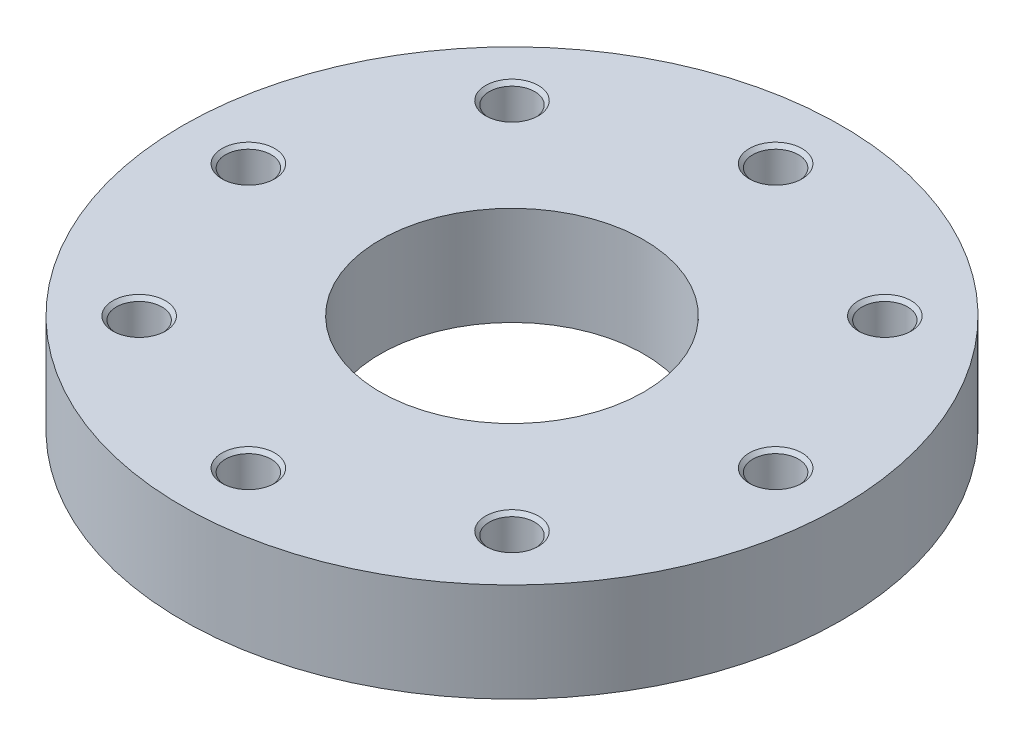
ISO-10303-21;
HEADER;
FILE_DESCRIPTION(('STEP AP214'),'2;1');
FILE_NAME('part.step','',(''),(''),'','','');
FILE_SCHEMA(('AUTOMOTIVE_DESIGN { 1 0 10303 214 1 1 1 1 }'));
ENDSEC;
DATA;
#1=APPLICATION_CONTEXT('core data for automotive mechanical design processes');
#2=APPLICATION_PROTOCOL_DEFINITION('international standard','automotive_design',2000,#1);
#3=PRODUCT_CONTEXT('',#1,'mechanical');
#4=PRODUCT('Part','Part','',(#3));
#5=PRODUCT_RELATED_PRODUCT_CATEGORY('part','',(#4));
#6=PRODUCT_DEFINITION_FORMATION('','',#4);
#7=PRODUCT_DEFINITION_CONTEXT('part definition',#1,'design');
#8=PRODUCT_DEFINITION('design','',#6,#7);
#9=PRODUCT_DEFINITION_SHAPE('','',#8);
#10=(LENGTH_UNIT() NAMED_UNIT(*) SI_UNIT(.MILLI.,.METRE.));
#11=(NAMED_UNIT(*) PLANE_ANGLE_UNIT() SI_UNIT($,.RADIAN.));
#12=(NAMED_UNIT(*) SI_UNIT($,.STERADIAN.) SOLID_ANGLE_UNIT());
#13=UNCERTAINTY_MEASURE_WITH_UNIT(LENGTH_MEASURE(1.E-05),#10,'distance_accuracy_value','');
#14=(GEOMETRIC_REPRESENTATION_CONTEXT(3) GLOBAL_UNCERTAINTY_ASSIGNED_CONTEXT((#13)) GLOBAL_UNIT_ASSIGNED_CONTEXT((#10,
#11,#12)) REPRESENTATION_CONTEXT('',''));
#15=CARTESIAN_POINT('',(0.,0.,0.));
#16=DIRECTION('',(0.,0.,1.));
#17=DIRECTION('',(1.,0.,0.));
#18=AXIS2_PLACEMENT_3D('',#15,#16,#17);
#19=CARTESIAN_POINT('',(0.,15.,0.));
#20=DIRECTION('',(0.,-1.,0.));
#21=DIRECTION('',(1.,0.,0.));
#22=AXIS2_PLACEMENT_3D('',#19,#20,#21);
#23=CYLINDRICAL_SURFACE('',#22,100.);
#24=CARTESIAN_POINT('',(0.,0.,0.));
#25=DIRECTION('',(0.,1.,0.));
#26=DIRECTION('',(1.,0.,0.));
#27=AXIS2_PLACEMENT_3D('',#24,#25,#26);
#28=CIRCLE('',#27,100.);
#29=CARTESIAN_POINT('',(100.,0.,0.));
#30=VERTEX_POINT('',#29);
#31=EDGE_CURVE('E9',#30,#30,#28,.T.);
#32=ORIENTED_EDGE('',*,*,#31,.T.);
#33=EDGE_LOOP('',(#32));
#34=FACE_BOUND('',#33,.T.);
#35=CARTESIAN_POINT('',(0.,30.,0.));
#36=DIRECTION('',(0.,1.,0.));
#37=DIRECTION('',(1.,0.,0.));
#38=AXIS2_PLACEMENT_3D('',#35,#36,#37);
#39=CIRCLE('',#38,100.);
#40=CARTESIAN_POINT('',(100.,30.,0.));
#41=VERTEX_POINT('',#40);
#42=EDGE_CURVE('E257',#41,#41,#39,.T.);
#43=ORIENTED_EDGE('',*,*,#42,.F.);
#44=EDGE_LOOP('',(#43));
#45=FACE_BOUND('',#44,.T.);
#46=ADVANCED_FACE('F15',(#34,#45),#23,.T.);
#47=CARTESIAN_POINT('',(70.,0.,0.));
#48=DIRECTION('',(0.,-1.,0.));
#49=DIRECTION('',(-1.,0.,0.));
#50=AXIS2_PLACEMENT_3D('',#47,#48,#49);
#51=PLANE('',#50);
#52=CARTESIAN_POINT('',(0.,0.,0.));
#53=DIRECTION('',(0.,1.,0.));
#54=DIRECTION('',(1.,0.,0.));
#55=AXIS2_PLACEMENT_3D('',#52,#53,#54);
#56=CIRCLE('',#55,40.);
#57=CARTESIAN_POINT('',(40.,0.,0.));
#58=VERTEX_POINT('',#57);
#59=EDGE_CURVE('E25',#58,#58,#56,.T.);
#60=ORIENTED_EDGE('',*,*,#59,.T.);
#61=EDGE_LOOP('',(#60));
#62=FACE_BOUND('',#61,.T.);
#63=ORIENTED_EDGE('',*,*,#31,.F.);
#64=EDGE_LOOP('',(#63));
#65=FACE_BOUND('',#64,.T.);
#66=ADVANCED_FACE('F322',(#62,#65),#51,.T.);
#67=CARTESIAN_POINT('',(0.,15.,0.));
#68=DIRECTION('',(0.,-1.,0.));
#69=DIRECTION('',(1.,0.,0.));
#70=AXIS2_PLACEMENT_3D('',#67,#68,#69);
#71=CYLINDRICAL_SURFACE('',#70,40.);
#72=CARTESIAN_POINT('',(0.,30.,0.));
#73=DIRECTION('',(0.,1.,0.));
#74=DIRECTION('',(1.,0.,0.));
#75=AXIS2_PLACEMENT_3D('',#72,#73,#74);
#76=CIRCLE('',#75,40.);
#77=CARTESIAN_POINT('',(40.,30.,0.));
#78=VERTEX_POINT('',#77);
#79=EDGE_CURVE('E235',#78,#78,#76,.T.);
#80=ORIENTED_EDGE('',*,*,#79,.T.);
#81=EDGE_LOOP('',(#80));
#82=FACE_BOUND('',#81,.T.);
#83=ORIENTED_EDGE('',*,*,#59,.F.);
#84=EDGE_LOOP('',(#83));
#85=FACE_BOUND('',#84,.T.);
#86=ADVANCED_FACE('F327',(#82,#85),#71,.F.);
#87=CARTESIAN_POINT('',(70.,30.,0.));
#88=DIRECTION('',(0.,1.,0.));
#89=DIRECTION('',(1.,0.,0.));
#90=AXIS2_PLACEMENT_3D('',#87,#88,#89);
#91=PLANE('',#90);
#92=ORIENTED_EDGE('',*,*,#42,.T.);
#93=EDGE_LOOP('',(#92));
#94=FACE_BOUND('',#93,.T.);
#95=ORIENTED_EDGE('',*,*,#79,.F.);
#96=EDGE_LOOP('',(#95));
#97=FACE_BOUND('',#96,.T.);
#98=CARTESIAN_POINT('',(80.,30.,0.));
#99=DIRECTION('',(0.,-1.,0.));
#100=DIRECTION('',(1.,0.,0.));
#101=AXIS2_PLACEMENT_3D('',#98,#99,#100);
#102=CIRCLE('',#101,8.);
#103=CARTESIAN_POINT('',(88.,30.,0.));
#104=VERTEX_POINT('',#103);
#105=EDGE_CURVE('E200',#104,#104,#102,.T.);
#106=ORIENTED_EDGE('',*,*,#105,.T.);
#107=EDGE_LOOP('',(#106));
#108=FACE_BOUND('',#107,.T.);
#109=CARTESIAN_POINT('',(56.5685424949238,30.,-56.5685424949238));
#110=DIRECTION('',(0.,-1.,0.));
#111=DIRECTION('',(0.707106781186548,0.,-0.707106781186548));
#112=AXIS2_PLACEMENT_3D('',#109,#110,#111);
#113=CIRCLE('',#112,8.);
#114=CARTESIAN_POINT('',(62.2253967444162,30.,-62.2253967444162));
#115=VERTEX_POINT('',#114);
#116=EDGE_CURVE('E272',#115,#115,#113,.T.);
#117=ORIENTED_EDGE('',*,*,#116,.T.);
#118=EDGE_LOOP('',(#117));
#119=FACE_BOUND('',#118,.T.);
#120=CARTESIAN_POINT('',(0.,30.,-80.));
#121=DIRECTION('',(0.,-1.,0.));
#122=DIRECTION('',(0.,0.,-1.));
#123=AXIS2_PLACEMENT_3D('',#120,#121,#122);
#124=CIRCLE('',#123,8.);
#125=CARTESIAN_POINT('',(0.,30.,-88.));
#126=VERTEX_POINT('',#125);
#127=EDGE_CURVE('E221',#126,#126,#124,.T.);
#128=ORIENTED_EDGE('',*,*,#127,.T.);
#129=EDGE_LOOP('',(#128));
#130=FACE_BOUND('',#129,.T.);
#131=CARTESIAN_POINT('',(-56.5685424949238,30.,-56.5685424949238));
#132=DIRECTION('',(0.,-1.,0.));
#133=DIRECTION('',(-0.707106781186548,0.,-0.707106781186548));
#134=AXIS2_PLACEMENT_3D('',#131,#132,#133);
#135=CIRCLE('',#134,8.);
#136=CARTESIAN_POINT('',(-62.2253967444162,30.,-62.2253967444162));
#137=VERTEX_POINT('',#136);
#138=EDGE_CURVE('E265',#137,#137,#135,.T.);
#139=ORIENTED_EDGE('',*,*,#138,.T.);
#140=EDGE_LOOP('',(#139));
#141=FACE_BOUND('',#140,.T.);
#142=CARTESIAN_POINT('',(-80.,30.,0.));
#143=DIRECTION('',(0.,-1.,0.));
#144=DIRECTION('',(-1.,0.,0.));
#145=AXIS2_PLACEMENT_3D('',#142,#143,#144);
#146=CIRCLE('',#145,8.);
#147=CARTESIAN_POINT('',(-88.,30.,0.));
#148=VERTEX_POINT('',#147);
#149=EDGE_CURVE('E251',#148,#148,#146,.T.);
#150=ORIENTED_EDGE('',*,*,#149,.T.);
#151=EDGE_LOOP('',(#150));
#152=FACE_BOUND('',#151,.T.);
#153=CARTESIAN_POINT('',(-56.5685424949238,30.,56.5685424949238));
#154=DIRECTION('',(0.,-1.,0.));
#155=DIRECTION('',(-0.707106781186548,0.,0.707106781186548));
#156=AXIS2_PLACEMENT_3D('',#153,#154,#155);
#157=CIRCLE('',#156,8.);
#158=CARTESIAN_POINT('',(-62.2253967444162,30.,62.2253967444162));
#159=VERTEX_POINT('',#158);
#160=EDGE_CURVE('E268',#159,#159,#157,.T.);
#161=ORIENTED_EDGE('',*,*,#160,.T.);
#162=EDGE_LOOP('',(#161));
#163=FACE_BOUND('',#162,.T.);
#164=CARTESIAN_POINT('',(0.,30.,80.));
#165=DIRECTION('',(0.,-1.,0.));
#166=DIRECTION('',(0.,0.,1.));
#167=AXIS2_PLACEMENT_3D('',#164,#165,#166);
#168=CIRCLE('',#167,8.);
#169=CARTESIAN_POINT('',(0.,30.,88.));
#170=VERTEX_POINT('',#169);
#171=EDGE_CURVE('E246',#170,#170,#168,.T.);
#172=ORIENTED_EDGE('',*,*,#171,.T.);
#173=EDGE_LOOP('',(#172));
#174=FACE_BOUND('',#173,.T.);
#175=CARTESIAN_POINT('',(56.5685424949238,30.,56.5685424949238));
#176=DIRECTION('',(0.,-1.,0.));
#177=DIRECTION('',(0.707106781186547,0.,0.707106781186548));
#178=AXIS2_PLACEMENT_3D('',#175,#176,#177);
#179=CIRCLE('',#178,8.);
#180=CARTESIAN_POINT('',(62.2253967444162,30.,62.2253967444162));
#181=VERTEX_POINT('',#180);
#182=EDGE_CURVE('E227',#181,#181,#179,.T.);
#183=ORIENTED_EDGE('',*,*,#182,.T.);
#184=EDGE_LOOP('',(#183));
#185=FACE_BOUND('',#184,.T.);
#186=ADVANCED_FACE('F201',(#94,#97,#108,#119,#130,#141,#152,#163,#174,#185),#91,.T.);
#187=CARTESIAN_POINT('',(80.,5.00308975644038,0.));
#188=DIRECTION('',(0.,1.,0.));
#189=DIRECTION('',(1.,0.,0.));
#190=AXIS2_PLACEMENT_3D('',#187,#188,#189);
#191=CONICAL_SURFACE('',#190,3.45875,1.0471975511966);
#192=CARTESIAN_POINT('',(80.,7.,0.));
#193=DIRECTION('',(0.,-1.,0.));
#194=DIRECTION('',(1.,0.,0.));
#195=AXIS2_PLACEMENT_3D('',#192,#193,#194);
#196=CIRCLE('',#195,6.9175);
#197=CARTESIAN_POINT('',(86.9175,7.,0.));
#198=VERTEX_POINT('',#197);
#199=EDGE_CURVE('E233',#198,#198,#196,.T.);
#200=ORIENTED_EDGE('',*,*,#199,.F.);
#201=EDGE_LOOP('',(#200));
#202=FACE_BOUND('',#201,.T.);
#203=CARTESIAN_POINT('',(80.,3.00617951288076,0.));
#204=VERTEX_POINT('',#203);
#205=VERTEX_LOOP('',#204);
#206=FACE_BOUND('',#205,.T.);
#207=ADVANCED_FACE('F341',(#202,#206),#191,.F.);
#208=CARTESIAN_POINT('',(80.,9.95875,0.));
#209=DIRECTION('',(0.,1.,0.));
#210=DIRECTION('',(1.,0.,0.));
#211=AXIS2_PLACEMENT_3D('',#208,#209,#210);
#212=CYLINDRICAL_SURFACE('',#211,6.9175);
#213=CARTESIAN_POINT('',(80.,12.9175,0.));
#214=DIRECTION('',(0.,-1.,0.));
#215=DIRECTION('',(1.,0.,0.));
#216=AXIS2_PLACEMENT_3D('',#213,#214,#215);
#217=CIRCLE('',#216,6.9175);
#218=CARTESIAN_POINT('',(86.9175,12.9175,0.));
#219=VERTEX_POINT('',#218);
#220=EDGE_CURVE('E236',#219,#219,#217,.T.);
#221=ORIENTED_EDGE('',*,*,#220,.F.);
#222=EDGE_LOOP('',(#221));
#223=FACE_BOUND('',#222,.T.);
#224=ORIENTED_EDGE('',*,*,#199,.T.);
#225=EDGE_LOOP('',(#224));
#226=FACE_BOUND('',#225,.T.);
#227=ADVANCED_FACE('F344',(#223,#226),#212,.F.);
#228=CARTESIAN_POINT('',(80.,13.45875,0.));
#229=DIRECTION('',(0.,1.,0.));
#230=DIRECTION('',(1.,0.,0.));
#231=AXIS2_PLACEMENT_3D('',#228,#229,#230);
#232=CONICAL_SURFACE('',#231,7.45875,0.785398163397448);
#233=CARTESIAN_POINT('',(80.,14.,0.));
#234=DIRECTION('',(0.,-1.,0.));
#235=DIRECTION('',(1.,0.,0.));
#236=AXIS2_PLACEMENT_3D('',#233,#234,#235);
#237=CIRCLE('',#236,8.);
#238=CARTESIAN_POINT('',(88.,14.,0.));
#239=VERTEX_POINT('',#238);
#240=EDGE_CURVE('E206',#239,#239,#237,.T.);
#241=ORIENTED_EDGE('',*,*,#240,.F.);
#242=EDGE_LOOP('',(#241));
#243=FACE_BOUND('',#242,.T.);
#244=ORIENTED_EDGE('',*,*,#220,.T.);
#245=EDGE_LOOP('',(#244));
#246=FACE_BOUND('',#245,.T.);
#247=ADVANCED_FACE('F400',(#243,#246),#232,.F.);
#248=CARTESIAN_POINT('',(87.45875,14.,0.));
#249=DIRECTION('',(0.,1.,0.));
#250=DIRECTION('',(-1.,0.,0.));
#251=AXIS2_PLACEMENT_3D('',#248,#249,#250);
#252=PLANE('',#251);
#253=CARTESIAN_POINT('',(80.,14.,0.));
#254=DIRECTION('',(0.,-1.,0.));
#255=DIRECTION('',(1.,0.,0.));
#256=AXIS2_PLACEMENT_3D('',#253,#254,#255);
#257=CIRCLE('',#256,6.9175);
#258=CARTESIAN_POINT('',(86.9175,14.,0.));
#259=VERTEX_POINT('',#258);
#260=EDGE_CURVE('E194',#259,#259,#257,.T.);
#261=ORIENTED_EDGE('',*,*,#260,.F.);
#262=EDGE_LOOP('',(#261));
#263=FACE_BOUND('',#262,.T.);
#264=ORIENTED_EDGE('',*,*,#240,.T.);
#265=EDGE_LOOP('',(#264));
#266=FACE_BOUND('',#265,.T.);
#267=ADVANCED_FACE('F361',(#263,#266),#252,.F.);
#268=CARTESIAN_POINT('',(80.,21.45875,0.));
#269=DIRECTION('',(0.,1.,0.));
#270=DIRECTION('',(1.,0.,0.));
#271=AXIS2_PLACEMENT_3D('',#268,#269,#270);
#272=CYLINDRICAL_SURFACE('',#271,6.9175);
#273=CARTESIAN_POINT('',(80.,28.9175,0.));
#274=DIRECTION('',(0.,-1.,0.));
#275=DIRECTION('',(1.,0.,0.));
#276=AXIS2_PLACEMENT_3D('',#273,#274,#275);
#277=CIRCLE('',#276,6.9175);
#278=CARTESIAN_POINT('',(86.9175,28.9175,0.));
#279=VERTEX_POINT('',#278);
#280=EDGE_CURVE('E204',#279,#279,#277,.T.);
#281=ORIENTED_EDGE('',*,*,#280,.F.);
#282=EDGE_LOOP('',(#281));
#283=FACE_BOUND('',#282,.T.);
#284=ORIENTED_EDGE('',*,*,#260,.T.);
#285=EDGE_LOOP('',(#284));
#286=FACE_BOUND('',#285,.T.);
#287=ADVANCED_FACE('F357',(#283,#286),#272,.F.);
#288=CARTESIAN_POINT('',(80.,29.45875,0.));
#289=DIRECTION('',(0.,1.,0.));
#290=DIRECTION('',(1.,0.,0.));
#291=AXIS2_PLACEMENT_3D('',#288,#289,#290);
#292=CONICAL_SURFACE('',#291,7.45875,0.785398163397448);
#293=ORIENTED_EDGE('',*,*,#105,.F.);
#294=EDGE_LOOP('',(#293));
#295=FACE_BOUND('',#294,.T.);
#296=ORIENTED_EDGE('',*,*,#280,.T.);
#297=EDGE_LOOP('',(#296));
#298=FACE_BOUND('',#297,.T.);
#299=ADVANCED_FACE('F360',(#295,#298),#292,.F.);
#300=CARTESIAN_POINT('',(56.5685424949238,5.00308975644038,-56.5685424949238));
#301=DIRECTION('',(0.,1.,0.));
#302=DIRECTION('',(0.707106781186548,0.,-0.707106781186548));
#303=AXIS2_PLACEMENT_3D('',#300,#301,#302);
#304=CONICAL_SURFACE('',#303,3.45875,1.0471975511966);
#305=CARTESIAN_POINT('',(56.5685424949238,7.,-56.5685424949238));
#306=DIRECTION('',(0.,-1.,0.));
#307=DIRECTION('',(0.707106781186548,0.,-0.707106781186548));
#308=AXIS2_PLACEMENT_3D('',#305,#306,#307);
#309=CIRCLE('',#308,6.9175);
#310=CARTESIAN_POINT('',(61.4599536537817,7.,-61.4599536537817));
#311=VERTEX_POINT('',#310);
#312=EDGE_CURVE('E208',#311,#311,#309,.T.);
#313=ORIENTED_EDGE('',*,*,#312,.F.);
#314=EDGE_LOOP('',(#313));
#315=FACE_BOUND('',#314,.T.);
#316=CARTESIAN_POINT('',(56.5685424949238,3.00617951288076,-56.5685424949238));
#317=VERTEX_POINT('',#316);
#318=VERTEX_LOOP('',#317);
#319=FACE_BOUND('',#318,.T.);
#320=ADVANCED_FACE('F349',(#315,#319),#304,.F.);
#321=CARTESIAN_POINT('',(56.5685424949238,9.95875,-56.5685424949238));
#322=DIRECTION('',(0.,1.,0.));
#323=DIRECTION('',(0.707106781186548,0.,-0.707106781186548));
#324=AXIS2_PLACEMENT_3D('',#321,#322,#323);
#325=CYLINDRICAL_SURFACE('',#324,6.9175);
#326=CARTESIAN_POINT('',(56.5685424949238,12.9175,-56.5685424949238));
#327=DIRECTION('',(0.,-1.,0.));
#328=DIRECTION('',(0.707106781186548,0.,-0.707106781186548));
#329=AXIS2_PLACEMENT_3D('',#326,#327,#328);
#330=CIRCLE('',#329,6.9175);
#331=CARTESIAN_POINT('',(61.4599536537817,12.9175,-61.4599536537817));
#332=VERTEX_POINT('',#331);
#333=EDGE_CURVE('E231',#332,#332,#330,.T.);
#334=ORIENTED_EDGE('',*,*,#333,.F.);
#335=EDGE_LOOP('',(#334));
#336=FACE_BOUND('',#335,.T.);
#337=ORIENTED_EDGE('',*,*,#312,.T.);
#338=EDGE_LOOP('',(#337));
#339=FACE_BOUND('',#338,.T.);
#340=ADVANCED_FACE('F346',(#336,#339),#325,.F.);
#341=CARTESIAN_POINT('',(56.5685424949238,13.45875,-56.5685424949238));
#342=DIRECTION('',(0.,1.,0.));
#343=DIRECTION('',(0.707106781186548,0.,-0.707106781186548));
#344=AXIS2_PLACEMENT_3D('',#341,#342,#343);
#345=CONICAL_SURFACE('',#344,7.45875,0.785398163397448);
#346=CARTESIAN_POINT('',(56.5685424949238,14.,-56.5685424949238));
#347=DIRECTION('',(0.,-1.,0.));
#348=DIRECTION('',(0.707106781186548,0.,-0.707106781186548));
#349=AXIS2_PLACEMENT_3D('',#346,#347,#348);
#350=CIRCLE('',#349,8.);
#351=CARTESIAN_POINT('',(62.2253967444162,14.,-62.2253967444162));
#352=VERTEX_POINT('',#351);
#353=EDGE_CURVE('E229',#352,#352,#350,.T.);
#354=ORIENTED_EDGE('',*,*,#353,.F.);
#355=EDGE_LOOP('',(#354));
#356=FACE_BOUND('',#355,.T.);
#357=ORIENTED_EDGE('',*,*,#333,.T.);
#358=EDGE_LOOP('',(#357));
#359=FACE_BOUND('',#358,.T.);
#360=ADVANCED_FACE('F333',(#356,#359),#345,.F.);
#361=CARTESIAN_POINT('',(61.842675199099,14.,-61.842675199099));
#362=DIRECTION('',(0.,1.,0.));
#363=DIRECTION('',(-0.707106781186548,0.,0.707106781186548));
#364=AXIS2_PLACEMENT_3D('',#361,#362,#363);
#365=PLANE('',#364);
#366=CARTESIAN_POINT('',(56.5685424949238,14.,-56.5685424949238));
#367=DIRECTION('',(0.,-1.,0.));
#368=DIRECTION('',(0.707106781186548,0.,-0.707106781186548));
#369=AXIS2_PLACEMENT_3D('',#366,#367,#368);
#370=CIRCLE('',#369,6.9175);
#371=CARTESIAN_POINT('',(61.4599536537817,14.,-61.4599536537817));
#372=VERTEX_POINT('',#371);
#373=EDGE_CURVE('E232',#372,#372,#370,.T.);
#374=ORIENTED_EDGE('',*,*,#373,.F.);
#375=EDGE_LOOP('',(#374));
#376=FACE_BOUND('',#375,.T.);
#377=ORIENTED_EDGE('',*,*,#353,.T.);
#378=EDGE_LOOP('',(#377));
#379=FACE_BOUND('',#378,.T.);
#380=ADVANCED_FACE('F551',(#376,#379),#365,.F.);
#381=CARTESIAN_POINT('',(56.5685424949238,21.45875,-56.5685424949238));
#382=DIRECTION('',(0.,1.,0.));
#383=DIRECTION('',(0.707106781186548,0.,-0.707106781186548));
#384=AXIS2_PLACEMENT_3D('',#381,#382,#383);
#385=CYLINDRICAL_SURFACE('',#384,6.9175);
#386=CARTESIAN_POINT('',(56.5685424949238,28.9175,-56.5685424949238));
#387=DIRECTION('',(0.,-1.,0.));
#388=DIRECTION('',(0.707106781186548,0.,-0.707106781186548));
#389=AXIS2_PLACEMENT_3D('',#386,#387,#388);
#390=CIRCLE('',#389,6.9175);
#391=CARTESIAN_POINT('',(61.4599536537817,28.9175,-61.4599536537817));
#392=VERTEX_POINT('',#391);
#393=EDGE_CURVE('E239',#392,#392,#390,.T.);
#394=ORIENTED_EDGE('',*,*,#393,.F.);
#395=EDGE_LOOP('',(#394));
#396=FACE_BOUND('',#395,.T.);
#397=ORIENTED_EDGE('',*,*,#373,.T.);
#398=EDGE_LOOP('',(#397));
#399=FACE_BOUND('',#398,.T.);
#400=ADVANCED_FACE('F17',(#396,#399),#385,.F.);
#401=CARTESIAN_POINT('',(56.5685424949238,29.45875,-56.5685424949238));
#402=DIRECTION('',(0.,1.,0.));
#403=DIRECTION('',(0.707106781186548,0.,-0.707106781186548));
#404=AXIS2_PLACEMENT_3D('',#401,#402,#403);
#405=CONICAL_SURFACE('',#404,7.45875,0.785398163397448);
#406=ORIENTED_EDGE('',*,*,#116,.F.);
#407=EDGE_LOOP('',(#406));
#408=FACE_BOUND('',#407,.T.);
#409=ORIENTED_EDGE('',*,*,#393,.T.);
#410=EDGE_LOOP('',(#409));
#411=FACE_BOUND('',#410,.T.);
#412=ADVANCED_FACE('F382',(#408,#411),#405,.F.);
#413=CARTESIAN_POINT('',(0.,5.00308975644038,-80.));
#414=DIRECTION('',(0.,1.,0.));
#415=DIRECTION('',(0.,0.,-1.));
#416=AXIS2_PLACEMENT_3D('',#413,#414,#415);
#417=CONICAL_SURFACE('',#416,3.45875,1.0471975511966);
#418=CARTESIAN_POINT('',(0.,7.,-80.));
#419=DIRECTION('',(0.,-1.,0.));
#420=DIRECTION('',(0.,0.,-1.));
#421=AXIS2_PLACEMENT_3D('',#418,#419,#420);
#422=CIRCLE('',#421,6.9175);
#423=CARTESIAN_POINT('',(0.,7.,-86.9175));
#424=VERTEX_POINT('',#423);
#425=EDGE_CURVE('E237',#424,#424,#422,.T.);
#426=ORIENTED_EDGE('',*,*,#425,.F.);
#427=EDGE_LOOP('',(#426));
#428=FACE_BOUND('',#427,.T.);
#429=CARTESIAN_POINT('',(0.,3.00617951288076,-80.));
#430=VERTEX_POINT('',#429);
#431=VERTEX_LOOP('',#430);
#432=FACE_BOUND('',#431,.T.);
#433=ADVANCED_FACE('F378',(#428,#432),#417,.F.);
#434=CARTESIAN_POINT('',(0.,9.95875,-80.));
#435=DIRECTION('',(0.,1.,0.));
#436=DIRECTION('',(0.,0.,-1.));
#437=AXIS2_PLACEMENT_3D('',#434,#435,#436);
#438=CYLINDRICAL_SURFACE('',#437,6.9175);
#439=CARTESIAN_POINT('',(0.,12.9175,-80.));
#440=DIRECTION('',(0.,-1.,0.));
#441=DIRECTION('',(0.,0.,-1.));
#442=AXIS2_PLACEMENT_3D('',#439,#440,#441);
#443=CIRCLE('',#442,6.9175);
#444=CARTESIAN_POINT('',(0.,12.9175,-86.9175));
#445=VERTEX_POINT('',#444);
#446=EDGE_CURVE('E240',#445,#445,#443,.T.);
#447=ORIENTED_EDGE('',*,*,#446,.F.);
#448=EDGE_LOOP('',(#447));
#449=FACE_BOUND('',#448,.T.);
#450=ORIENTED_EDGE('',*,*,#425,.T.);
#451=EDGE_LOOP('',(#450));
#452=FACE_BOUND('',#451,.T.);
#453=ADVANCED_FACE('F381',(#449,#452),#438,.F.);
#454=CARTESIAN_POINT('',(0.,13.45875,-80.));
#455=DIRECTION('',(0.,1.,0.));
#456=DIRECTION('',(0.,0.,-1.));
#457=AXIS2_PLACEMENT_3D('',#454,#455,#456);
#458=CONICAL_SURFACE('',#457,7.45875,0.785398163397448);
#459=CARTESIAN_POINT('',(0.,14.,-80.));
#460=DIRECTION('',(0.,-1.,0.));
#461=DIRECTION('',(0.,0.,-1.));
#462=AXIS2_PLACEMENT_3D('',#459,#460,#461);
#463=CIRCLE('',#462,8.);
#464=CARTESIAN_POINT('',(0.,14.,-88.));
#465=VERTEX_POINT('',#464);
#466=EDGE_CURVE('E220',#465,#465,#463,.T.);
#467=ORIENTED_EDGE('',*,*,#466,.F.);
#468=EDGE_LOOP('',(#467));
#469=FACE_BOUND('',#468,.T.);
#470=ORIENTED_EDGE('',*,*,#446,.T.);
#471=EDGE_LOOP('',(#470));
#472=FACE_BOUND('',#471,.T.);
#473=ADVANCED_FACE('F424',(#469,#472),#458,.F.);
#474=CARTESIAN_POINT('',(0.,14.,-87.45875));
#475=DIRECTION('',(0.,1.,0.));
#476=DIRECTION('',(0.,0.,1.));
#477=AXIS2_PLACEMENT_3D('',#474,#475,#476);
#478=PLANE('',#477);
#479=CARTESIAN_POINT('',(0.,14.,-80.));
#480=DIRECTION('',(0.,-1.,0.));
#481=DIRECTION('',(0.,0.,-1.));
#482=AXIS2_PLACEMENT_3D('',#479,#480,#481);
#483=CIRCLE('',#482,6.9175);
#484=CARTESIAN_POINT('',(0.,14.,-86.9175));
#485=VERTEX_POINT('',#484);
#486=EDGE_CURVE('E218',#485,#485,#483,.T.);
#487=ORIENTED_EDGE('',*,*,#486,.F.);
#488=EDGE_LOOP('',(#487));
#489=FACE_BOUND('',#488,.T.);
#490=ORIENTED_EDGE('',*,*,#466,.T.);
#491=EDGE_LOOP('',(#490));
#492=FACE_BOUND('',#491,.T.);
#493=ADVANCED_FACE('F434',(#489,#492),#478,.F.);
#494=CARTESIAN_POINT('',(0.,21.45875,-80.));
#495=DIRECTION('',(0.,1.,0.));
#496=DIRECTION('',(0.,0.,-1.));
#497=AXIS2_PLACEMENT_3D('',#494,#495,#496);
#498=CYLINDRICAL_SURFACE('',#497,6.9175);
#499=CARTESIAN_POINT('',(0.,28.9175,-80.));
#500=DIRECTION('',(0.,-1.,0.));
#501=DIRECTION('',(0.,0.,-1.));
#502=AXIS2_PLACEMENT_3D('',#499,#500,#501);
#503=CIRCLE('',#502,6.9175);
#504=CARTESIAN_POINT('',(0.,28.9175,-86.9175));
#505=VERTEX_POINT('',#504);
#506=EDGE_CURVE('E222',#505,#505,#503,.T.);
#507=ORIENTED_EDGE('',*,*,#506,.F.);
#508=EDGE_LOOP('',(#507));
#509=FACE_BOUND('',#508,.T.);
#510=ORIENTED_EDGE('',*,*,#486,.T.);
#511=EDGE_LOOP('',(#510));
#512=FACE_BOUND('',#511,.T.);
#513=ADVANCED_FACE('F497',(#509,#512),#498,.F.);
#514=CARTESIAN_POINT('',(0.,29.45875,-80.));
#515=DIRECTION('',(0.,1.,0.));
#516=DIRECTION('',(0.,0.,-1.));
#517=AXIS2_PLACEMENT_3D('',#514,#515,#516);
#518=CONICAL_SURFACE('',#517,7.45875,0.785398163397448);
#519=ORIENTED_EDGE('',*,*,#127,.F.);
#520=EDGE_LOOP('',(#519));
#521=FACE_BOUND('',#520,.T.);
#522=ORIENTED_EDGE('',*,*,#506,.T.);
#523=EDGE_LOOP('',(#522));
#524=FACE_BOUND('',#523,.T.);
#525=ADVANCED_FACE('F439',(#521,#524),#518,.F.);
#526=CARTESIAN_POINT('',(-56.5685424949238,5.00308975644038,-56.5685424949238));
#527=DIRECTION('',(0.,1.,0.));
#528=DIRECTION('',(-0.707106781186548,0.,-0.707106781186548));
#529=AXIS2_PLACEMENT_3D('',#526,#527,#528);
#530=CONICAL_SURFACE('',#529,3.45875,1.0471975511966);
#531=CARTESIAN_POINT('',(-56.5685424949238,7.,-56.5685424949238));
#532=DIRECTION('',(0.,-1.,0.));
#533=DIRECTION('',(-0.707106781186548,0.,-0.707106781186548));
#534=AXIS2_PLACEMENT_3D('',#531,#532,#533);
#535=CIRCLE('',#534,6.9175);
#536=CARTESIAN_POINT('',(-61.4599536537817,7.,-61.4599536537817));
#537=VERTEX_POINT('',#536);
#538=EDGE_CURVE('E224',#537,#537,#535,.T.);
#539=ORIENTED_EDGE('',*,*,#538,.F.);
#540=EDGE_LOOP('',(#539));
#541=FACE_BOUND('',#540,.T.);
#542=CARTESIAN_POINT('',(-56.5685424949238,3.00617951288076,-56.5685424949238));
#543=VERTEX_POINT('',#542);
#544=VERTEX_LOOP('',#543);
#545=FACE_BOUND('',#544,.T.);
#546=ADVANCED_FACE('F391',(#541,#545),#530,.F.);
#547=CARTESIAN_POINT('',(-56.5685424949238,9.95875,-56.5685424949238));
#548=DIRECTION('',(0.,1.,0.));
#549=DIRECTION('',(-0.707106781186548,0.,-0.707106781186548));
#550=AXIS2_PLACEMENT_3D('',#547,#548,#549);
#551=CYLINDRICAL_SURFACE('',#550,6.9175);
#552=CARTESIAN_POINT('',(-56.5685424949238,12.9175,-56.5685424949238));
#553=DIRECTION('',(0.,-1.,0.));
#554=DIRECTION('',(-0.707106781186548,0.,-0.707106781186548));
#555=AXIS2_PLACEMENT_3D('',#552,#553,#554);
#556=CIRCLE('',#555,6.9175);
#557=CARTESIAN_POINT('',(-61.4599536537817,12.9175,-61.4599536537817));
#558=VERTEX_POINT('',#557);
#559=EDGE_CURVE('E241',#558,#558,#556,.T.);
#560=ORIENTED_EDGE('',*,*,#559,.F.);
#561=EDGE_LOOP('',(#560));
#562=FACE_BOUND('',#561,.T.);
#563=ORIENTED_EDGE('',*,*,#538,.T.);
#564=EDGE_LOOP('',(#563));
#565=FACE_BOUND('',#564,.T.);
#566=ADVANCED_FACE('F387',(#562,#565),#551,.F.);
#567=CARTESIAN_POINT('',(-56.5685424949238,13.45875,-56.5685424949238));
#568=DIRECTION('',(0.,1.,0.));
#569=DIRECTION('',(-0.707106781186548,0.,-0.707106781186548));
#570=AXIS2_PLACEMENT_3D('',#567,#568,#569);
#571=CONICAL_SURFACE('',#570,7.45875,0.785398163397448);
#572=CARTESIAN_POINT('',(-56.5685424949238,14.,-56.5685424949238));
#573=DIRECTION('',(0.,-1.,0.));
#574=DIRECTION('',(-0.707106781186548,0.,-0.707106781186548));
#575=AXIS2_PLACEMENT_3D('',#572,#573,#574);
#576=CIRCLE('',#575,8.);
#577=CARTESIAN_POINT('',(-62.2253967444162,14.,-62.2253967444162));
#578=VERTEX_POINT('',#577);
#579=EDGE_CURVE('E243',#578,#578,#576,.T.);
#580=ORIENTED_EDGE('',*,*,#579,.F.);
#581=EDGE_LOOP('',(#580));
#582=FACE_BOUND('',#581,.T.);
#583=ORIENTED_EDGE('',*,*,#559,.T.);
#584=EDGE_LOOP('',(#583));
#585=FACE_BOUND('',#584,.T.);
#586=ADVANCED_FACE('F390',(#582,#585),#571,.F.);
#587=CARTESIAN_POINT('',(-61.842675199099,14.,-61.842675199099));
#588=DIRECTION('',(0.,1.,0.));
#589=DIRECTION('',(0.707106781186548,0.,0.707106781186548));
#590=AXIS2_PLACEMENT_3D('',#587,#588,#589);
#591=PLANE('',#590);
#592=CARTESIAN_POINT('',(-56.5685424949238,14.,-56.5685424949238));
#593=DIRECTION('',(0.,-1.,0.));
#594=DIRECTION('',(-0.707106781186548,0.,-0.707106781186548));
#595=AXIS2_PLACEMENT_3D('',#592,#593,#594);
#596=CIRCLE('',#595,6.9175);
#597=CARTESIAN_POINT('',(-61.4599536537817,14.,-61.4599536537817));
#598=VERTEX_POINT('',#597);
#599=EDGE_CURVE('E255',#598,#598,#596,.T.);
#600=ORIENTED_EDGE('',*,*,#599,.F.);
#601=EDGE_LOOP('',(#600));
#602=FACE_BOUND('',#601,.T.);
#603=ORIENTED_EDGE('',*,*,#579,.T.);
#604=EDGE_LOOP('',(#603));
#605=FACE_BOUND('',#604,.T.);
#606=ADVANCED_FACE('F364',(#602,#605),#591,.F.);
#607=CARTESIAN_POINT('',(-56.5685424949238,21.45875,-56.5685424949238));
#608=DIRECTION('',(0.,1.,0.));
#609=DIRECTION('',(-0.707106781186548,0.,-0.707106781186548));
#610=AXIS2_PLACEMENT_3D('',#607,#608,#609);
#611=CYLINDRICAL_SURFACE('',#610,6.9175);
#612=CARTESIAN_POINT('',(-56.5685424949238,28.9175,-56.5685424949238));
#613=DIRECTION('',(0.,-1.,0.));
#614=DIRECTION('',(-0.707106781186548,0.,-0.707106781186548));
#615=AXIS2_PLACEMENT_3D('',#612,#613,#614);
#616=CIRCLE('',#615,6.9175);
#617=CARTESIAN_POINT('',(-61.4599536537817,28.9175,-61.4599536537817));
#618=VERTEX_POINT('',#617);
#619=EDGE_CURVE('E267',#618,#618,#616,.T.);
#620=ORIENTED_EDGE('',*,*,#619,.F.);
#621=EDGE_LOOP('',(#620));
#622=FACE_BOUND('',#621,.T.);
#623=ORIENTED_EDGE('',*,*,#599,.T.);
#624=EDGE_LOOP('',(#623));
#625=FACE_BOUND('',#624,.T.);
#626=ADVANCED_FACE('F339',(#622,#625),#611,.F.);
#627=CARTESIAN_POINT('',(-56.5685424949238,29.45875,-56.5685424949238));
#628=DIRECTION('',(0.,1.,0.));
#629=DIRECTION('',(-0.707106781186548,0.,-0.707106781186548));
#630=AXIS2_PLACEMENT_3D('',#627,#628,#629);
#631=CONICAL_SURFACE('',#630,7.45875,0.785398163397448);
#632=ORIENTED_EDGE('',*,*,#138,.F.);
#633=EDGE_LOOP('',(#632));
#634=FACE_BOUND('',#633,.T.);
#635=ORIENTED_EDGE('',*,*,#619,.T.);
#636=EDGE_LOOP('',(#635));
#637=FACE_BOUND('',#636,.T.);
#638=ADVANCED_FACE('F335',(#634,#637),#631,.F.);
#639=CARTESIAN_POINT('',(-80.,5.00308975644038,0.));
#640=DIRECTION('',(0.,1.,0.));
#641=DIRECTION('',(-1.,0.,0.));
#642=AXIS2_PLACEMENT_3D('',#639,#640,#641);
#643=CONICAL_SURFACE('',#642,3.45875,1.0471975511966);
#644=CARTESIAN_POINT('',(-80.,7.,0.));
#645=DIRECTION('',(0.,-1.,0.));
#646=DIRECTION('',(-1.,0.,0.));
#647=AXIS2_PLACEMENT_3D('',#644,#645,#646);
#648=CIRCLE('',#647,6.9175);
#649=CARTESIAN_POINT('',(-86.9175,7.,0.));
#650=VERTEX_POINT('',#649);
#651=EDGE_CURVE('E212',#650,#650,#648,.T.);
#652=ORIENTED_EDGE('',*,*,#651,.F.);
#653=EDGE_LOOP('',(#652));
#654=FACE_BOUND('',#653,.T.);
#655=CARTESIAN_POINT('',(-80.,3.00617951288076,0.));
#656=VERTEX_POINT('',#655);
#657=VERTEX_LOOP('',#656);
#658=FACE_BOUND('',#657,.T.);
#659=ADVANCED_FACE('F338',(#654,#658),#643,.F.);
#660=CARTESIAN_POINT('',(-80.,9.95875,0.));
#661=DIRECTION('',(0.,1.,0.));
#662=DIRECTION('',(-1.,0.,0.));
#663=AXIS2_PLACEMENT_3D('',#660,#661,#662);
#664=CYLINDRICAL_SURFACE('',#663,6.9175);
#665=CARTESIAN_POINT('',(-80.,12.9175,0.));
#666=DIRECTION('',(0.,-1.,0.));
#667=DIRECTION('',(-1.,0.,0.));
#668=AXIS2_PLACEMENT_3D('',#665,#666,#667);
#669=CIRCLE('',#668,6.9175);
#670=CARTESIAN_POINT('',(-86.9175,12.9175,0.));
#671=VERTEX_POINT('',#670);
#672=EDGE_CURVE('E278',#671,#671,#669,.T.);
#673=ORIENTED_EDGE('',*,*,#672,.F.);
#674=EDGE_LOOP('',(#673));
#675=FACE_BOUND('',#674,.T.);
#676=ORIENTED_EDGE('',*,*,#651,.T.);
#677=EDGE_LOOP('',(#676));
#678=FACE_BOUND('',#677,.T.);
#679=ADVANCED_FACE('F490',(#675,#678),#664,.F.);
#680=CARTESIAN_POINT('',(-80.,13.45875,0.));
#681=DIRECTION('',(0.,1.,0.));
#682=DIRECTION('',(-1.,0.,0.));
#683=AXIS2_PLACEMENT_3D('',#680,#681,#682);
#684=CONICAL_SURFACE('',#683,7.45875,0.785398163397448);
#685=CARTESIAN_POINT('',(-80.,14.,0.));
#686=DIRECTION('',(0.,-1.,0.));
#687=DIRECTION('',(-1.,0.,0.));
#688=AXIS2_PLACEMENT_3D('',#685,#686,#687);
#689=CIRCLE('',#688,8.);
#690=CARTESIAN_POINT('',(-88.,14.,0.));
#691=VERTEX_POINT('',#690);
#692=EDGE_CURVE('E279',#691,#691,#689,.T.);
#693=ORIENTED_EDGE('',*,*,#692,.F.);
#694=EDGE_LOOP('',(#693));
#695=FACE_BOUND('',#694,.T.);
#696=ORIENTED_EDGE('',*,*,#672,.T.);
#697=EDGE_LOOP('',(#696));
#698=FACE_BOUND('',#697,.T.);
#699=ADVANCED_FACE('F355',(#695,#698),#684,.F.);
#700=CARTESIAN_POINT('',(-87.45875,14.,0.));
#701=DIRECTION('',(0.,1.,0.));
#702=DIRECTION('',(1.,0.,0.));
#703=AXIS2_PLACEMENT_3D('',#700,#701,#702);
#704=PLANE('',#703);
#705=CARTESIAN_POINT('',(-80.,14.,0.));
#706=DIRECTION('',(0.,-1.,0.));
#707=DIRECTION('',(-1.,0.,0.));
#708=AXIS2_PLACEMENT_3D('',#705,#706,#707);
#709=CIRCLE('',#708,6.9175);
#710=CARTESIAN_POINT('',(-86.9175,14.,0.));
#711=VERTEX_POINT('',#710);
#712=EDGE_CURVE('E295',#711,#711,#709,.T.);
#713=ORIENTED_EDGE('',*,*,#712,.F.);
#714=EDGE_LOOP('',(#713));
#715=FACE_BOUND('',#714,.T.);
#716=ORIENTED_EDGE('',*,*,#692,.T.);
#717=EDGE_LOOP('',(#716));
#718=FACE_BOUND('',#717,.T.);
#719=ADVANCED_FACE('F351',(#715,#718),#704,.F.);
#720=CARTESIAN_POINT('',(-80.,21.45875,0.));
#721=DIRECTION('',(0.,1.,0.));
#722=DIRECTION('',(-1.,0.,0.));
#723=AXIS2_PLACEMENT_3D('',#720,#721,#722);
#724=CYLINDRICAL_SURFACE('',#723,6.9175);
#725=CARTESIAN_POINT('',(-80.,28.9175,0.));
#726=DIRECTION('',(0.,-1.,0.));
#727=DIRECTION('',(-1.,0.,0.));
#728=AXIS2_PLACEMENT_3D('',#725,#726,#727);
#729=CIRCLE('',#728,6.9175);
#730=CARTESIAN_POINT('',(-86.9175,28.9175,0.));
#731=VERTEX_POINT('',#730);
#732=EDGE_CURVE('E248',#731,#731,#729,.T.);
#733=ORIENTED_EDGE('',*,*,#732,.F.);
#734=EDGE_LOOP('',(#733));
#735=FACE_BOUND('',#734,.T.);
#736=ORIENTED_EDGE('',*,*,#712,.T.);
#737=EDGE_LOOP('',(#736));
#738=FACE_BOUND('',#737,.T.);
#739=ADVANCED_FACE('F354',(#735,#738),#724,.F.);
#740=CARTESIAN_POINT('',(-80.,29.45875,0.));
#741=DIRECTION('',(0.,1.,0.));
#742=DIRECTION('',(-1.,0.,0.));
#743=AXIS2_PLACEMENT_3D('',#740,#741,#742);
#744=CONICAL_SURFACE('',#743,7.45875,0.785398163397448);
#745=ORIENTED_EDGE('',*,*,#149,.F.);
#746=EDGE_LOOP('',(#745));
#747=FACE_BOUND('',#746,.T.);
#748=ORIENTED_EDGE('',*,*,#732,.T.);
#749=EDGE_LOOP('',(#748));
#750=FACE_BOUND('',#749,.T.);
#751=ADVANCED_FACE('F371',(#747,#750),#744,.F.);
#752=CARTESIAN_POINT('',(-56.5685424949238,5.00308975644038,56.5685424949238));
#753=DIRECTION('',(0.,1.,0.));
#754=DIRECTION('',(-0.707106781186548,0.,0.707106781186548));
#755=AXIS2_PLACEMENT_3D('',#752,#753,#754);
#756=CONICAL_SURFACE('',#755,3.45875,1.0471975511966);
#757=CARTESIAN_POINT('',(-56.5685424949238,7.,56.5685424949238));
#758=DIRECTION('',(0.,-1.,0.));
#759=DIRECTION('',(-0.707106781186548,0.,0.707106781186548));
#760=AXIS2_PLACEMENT_3D('',#757,#758,#759);
#761=CIRCLE('',#760,6.9175);
#762=CARTESIAN_POINT('',(-61.4599536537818,7.,61.4599536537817));
#763=VERTEX_POINT('',#762);
#764=EDGE_CURVE('E252',#763,#763,#761,.T.);
#765=ORIENTED_EDGE('',*,*,#764,.F.);
#766=EDGE_LOOP('',(#765));
#767=FACE_BOUND('',#766,.T.);
#768=CARTESIAN_POINT('',(-56.5685424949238,3.00617951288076,56.5685424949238));
#769=VERTEX_POINT('',#768);
#770=VERTEX_LOOP('',#769);
#771=FACE_BOUND('',#770,.T.);
#772=ADVANCED_FACE('F367',(#767,#771),#756,.F.);
#773=CARTESIAN_POINT('',(-56.5685424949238,9.95875,56.5685424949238));
#774=DIRECTION('',(0.,1.,0.));
#775=DIRECTION('',(-0.707106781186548,0.,0.707106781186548));
#776=AXIS2_PLACEMENT_3D('',#773,#774,#775);
#777=CYLINDRICAL_SURFACE('',#776,6.9175);
#778=CARTESIAN_POINT('',(-56.5685424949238,12.9175,56.5685424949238));
#779=DIRECTION('',(0.,-1.,0.));
#780=DIRECTION('',(-0.707106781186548,0.,0.707106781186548));
#781=AXIS2_PLACEMENT_3D('',#778,#779,#780);
#782=CIRCLE('',#781,6.9175);
#783=CARTESIAN_POINT('',(-61.4599536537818,12.9175,61.4599536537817));
#784=VERTEX_POINT('',#783);
#785=EDGE_CURVE('E216',#784,#784,#782,.T.);
#786=ORIENTED_EDGE('',*,*,#785,.F.);
#787=EDGE_LOOP('',(#786));
#788=FACE_BOUND('',#787,.T.);
#789=ORIENTED_EDGE('',*,*,#764,.T.);
#790=EDGE_LOOP('',(#789));
#791=FACE_BOUND('',#790,.T.);
#792=ADVANCED_FACE('F370',(#788,#791),#777,.F.);
#793=CARTESIAN_POINT('',(-56.5685424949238,13.45875,56.5685424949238));
#794=DIRECTION('',(0.,1.,0.));
#795=DIRECTION('',(-0.707106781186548,0.,0.707106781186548));
#796=AXIS2_PLACEMENT_3D('',#793,#794,#795);
#797=CONICAL_SURFACE('',#796,7.45875,0.785398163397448);
#798=CARTESIAN_POINT('',(-56.5685424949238,14.,56.5685424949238));
#799=DIRECTION('',(0.,-1.,0.));
#800=DIRECTION('',(-0.707106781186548,0.,0.707106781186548));
#801=AXIS2_PLACEMENT_3D('',#798,#799,#800);
#802=CIRCLE('',#801,8.);
#803=CARTESIAN_POINT('',(-62.2253967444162,14.,62.2253967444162));
#804=VERTEX_POINT('',#803);
#805=EDGE_CURVE('E214',#804,#804,#802,.T.);
#806=ORIENTED_EDGE('',*,*,#805,.F.);
#807=EDGE_LOOP('',(#806));
#808=FACE_BOUND('',#807,.T.);
#809=ORIENTED_EDGE('',*,*,#785,.T.);
#810=EDGE_LOOP('',(#809));
#811=FACE_BOUND('',#810,.T.);
#812=ADVANCED_FACE('F373',(#808,#811),#797,.F.);
#813=CARTESIAN_POINT('',(-61.842675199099,14.,61.842675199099));
#814=DIRECTION('',(0.,1.,0.));
#815=DIRECTION('',(0.707106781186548,0.,-0.707106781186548));
#816=AXIS2_PLACEMENT_3D('',#813,#814,#815);
#817=PLANE('',#816);
#818=CARTESIAN_POINT('',(-56.5685424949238,14.,56.5685424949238));
#819=DIRECTION('',(0.,-1.,0.));
#820=DIRECTION('',(-0.707106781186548,0.,0.707106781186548));
#821=AXIS2_PLACEMENT_3D('',#818,#819,#820);
#822=CIRCLE('',#821,6.9175);
#823=CARTESIAN_POINT('',(-61.4599536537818,14.,61.4599536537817));
#824=VERTEX_POINT('',#823);
#825=EDGE_CURVE('E217',#824,#824,#822,.T.);
#826=ORIENTED_EDGE('',*,*,#825,.F.);
#827=EDGE_LOOP('',(#826));
#828=FACE_BOUND('',#827,.T.);
#829=ORIENTED_EDGE('',*,*,#805,.T.);
#830=EDGE_LOOP('',(#829));
#831=FACE_BOUND('',#830,.T.);
#832=ADVANCED_FACE('F376',(#828,#831),#817,.F.);
#833=CARTESIAN_POINT('',(-56.5685424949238,21.45875,56.5685424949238));
#834=DIRECTION('',(0.,1.,0.));
#835=DIRECTION('',(-0.707106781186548,0.,0.707106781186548));
#836=AXIS2_PLACEMENT_3D('',#833,#834,#835);
#837=CYLINDRICAL_SURFACE('',#836,6.9175);
#838=CARTESIAN_POINT('',(-56.5685424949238,28.9175,56.5685424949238));
#839=DIRECTION('',(0.,-1.,0.));
#840=DIRECTION('',(-0.707106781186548,0.,0.707106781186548));
#841=AXIS2_PLACEMENT_3D('',#838,#839,#840);
#842=CIRCLE('',#841,6.9175);
#843=CARTESIAN_POINT('',(-61.4599536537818,28.9175,61.4599536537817));
#844=VERTEX_POINT('',#843);
#845=EDGE_CURVE('E260',#844,#844,#842,.T.);
#846=ORIENTED_EDGE('',*,*,#845,.F.);
#847=EDGE_LOOP('',(#846));
#848=FACE_BOUND('',#847,.T.);
#849=ORIENTED_EDGE('',*,*,#825,.T.);
#850=EDGE_LOOP('',(#849));
#851=FACE_BOUND('',#850,.T.);
#852=ADVANCED_FACE('F317',(#848,#851),#837,.F.);
#853=CARTESIAN_POINT('',(-56.5685424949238,29.45875,56.5685424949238));
#854=DIRECTION('',(0.,1.,0.));
#855=DIRECTION('',(-0.707106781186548,0.,0.707106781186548));
#856=AXIS2_PLACEMENT_3D('',#853,#854,#855);
#857=CONICAL_SURFACE('',#856,7.45875,0.785398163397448);
#858=ORIENTED_EDGE('',*,*,#160,.F.);
#859=EDGE_LOOP('',(#858));
#860=FACE_BOUND('',#859,.T.);
#861=ORIENTED_EDGE('',*,*,#845,.T.);
#862=EDGE_LOOP('',(#861));
#863=FACE_BOUND('',#862,.T.);
#864=ADVANCED_FACE('F311',(#860,#863),#857,.F.);
#865=CARTESIAN_POINT('',(0.,5.00308975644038,80.));
#866=DIRECTION('',(0.,1.,0.));
#867=DIRECTION('',(0.,0.,1.));
#868=AXIS2_PLACEMENT_3D('',#865,#866,#867);
#869=CONICAL_SURFACE('',#868,3.45875,1.0471975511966);
#870=CARTESIAN_POINT('',(0.,7.,80.));
#871=DIRECTION('',(0.,-1.,0.));
#872=DIRECTION('',(0.,0.,1.));
#873=AXIS2_PLACEMENT_3D('',#870,#871,#872);
#874=CIRCLE('',#873,6.9175);
#875=CARTESIAN_POINT('',(0.,7.,86.9175));
#876=VERTEX_POINT('',#875);
#877=EDGE_CURVE('E258',#876,#876,#874,.T.);
#878=ORIENTED_EDGE('',*,*,#877,.F.);
#879=EDGE_LOOP('',(#878));
#880=FACE_BOUND('',#879,.T.);
#881=CARTESIAN_POINT('',(0.,3.00617951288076,80.));
#882=VERTEX_POINT('',#881);
#883=VERTEX_LOOP('',#882);
#884=FACE_BOUND('',#883,.T.);
#885=ADVANCED_FACE('F306',(#880,#884),#869,.F.);
#886=CARTESIAN_POINT('',(0.,9.95875,80.));
#887=DIRECTION('',(0.,1.,0.));
#888=DIRECTION('',(0.,0.,1.));
#889=AXIS2_PLACEMENT_3D('',#886,#887,#888);
#890=CYLINDRICAL_SURFACE('',#889,6.9175);
#891=CARTESIAN_POINT('',(0.,12.9175,80.));
#892=DIRECTION('',(0.,-1.,0.));
#893=DIRECTION('',(0.,0.,1.));
#894=AXIS2_PLACEMENT_3D('',#891,#892,#893);
#895=CIRCLE('',#894,6.9175);
#896=CARTESIAN_POINT('',(0.,12.9175,86.9175));
#897=VERTEX_POINT('',#896);
#898=EDGE_CURVE('E261',#897,#897,#895,.T.);
#899=ORIENTED_EDGE('',*,*,#898,.F.);
#900=EDGE_LOOP('',(#899));
#901=FACE_BOUND('',#900,.T.);
#902=ORIENTED_EDGE('',*,*,#877,.T.);
#903=EDGE_LOOP('',(#902));
#904=FACE_BOUND('',#903,.T.);
#905=ADVANCED_FACE('F303',(#901,#904),#890,.F.);
#906=CARTESIAN_POINT('',(0.,13.45875,80.));
#907=DIRECTION('',(0.,1.,0.));
#908=DIRECTION('',(0.,0.,1.));
#909=AXIS2_PLACEMENT_3D('',#906,#907,#908);
#910=CONICAL_SURFACE('',#909,7.45875,0.785398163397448);
#911=CARTESIAN_POINT('',(0.,14.,80.));
#912=DIRECTION('',(0.,-1.,0.));
#913=DIRECTION('',(0.,0.,1.));
#914=AXIS2_PLACEMENT_3D('',#911,#912,#913);
#915=CIRCLE('',#914,8.);
#916=CARTESIAN_POINT('',(0.,14.,88.));
#917=VERTEX_POINT('',#916);
#918=EDGE_CURVE('E264',#917,#917,#915,.T.);
#919=ORIENTED_EDGE('',*,*,#918,.F.);
#920=EDGE_LOOP('',(#919));
#921=FACE_BOUND('',#920,.T.);
#922=ORIENTED_EDGE('',*,*,#898,.T.);
#923=EDGE_LOOP('',(#922));
#924=FACE_BOUND('',#923,.T.);
#925=ADVANCED_FACE('F301',(#921,#924),#910,.F.);
#926=CARTESIAN_POINT('',(0.,14.,87.45875));
#927=DIRECTION('',(0.,1.,0.));
#928=DIRECTION('',(0.,0.,-1.));
#929=AXIS2_PLACEMENT_3D('',#926,#927,#928);
#930=PLANE('',#929);
#931=CARTESIAN_POINT('',(0.,14.,80.));
#932=DIRECTION('',(0.,-1.,0.));
#933=DIRECTION('',(0.,0.,1.));
#934=AXIS2_PLACEMENT_3D('',#931,#932,#933);
#935=CIRCLE('',#934,6.9175);
#936=CARTESIAN_POINT('',(0.,14.,86.9175));
#937=VERTEX_POINT('',#936);
#938=EDGE_CURVE('E262',#937,#937,#935,.T.);
#939=ORIENTED_EDGE('',*,*,#938,.F.);
#940=EDGE_LOOP('',(#939));
#941=FACE_BOUND('',#940,.T.);
#942=ORIENTED_EDGE('',*,*,#918,.T.);
#943=EDGE_LOOP('',(#942));
#944=FACE_BOUND('',#943,.T.);
#945=ADVANCED_FACE('F441',(#941,#944),#930,.F.);
#946=CARTESIAN_POINT('',(0.,21.45875,80.));
#947=DIRECTION('',(0.,1.,0.));
#948=DIRECTION('',(0.,0.,1.));
#949=AXIS2_PLACEMENT_3D('',#946,#947,#948);
#950=CYLINDRICAL_SURFACE('',#949,6.9175);
#951=CARTESIAN_POINT('',(0.,28.9175,80.));
#952=DIRECTION('',(0.,-1.,0.));
#953=DIRECTION('',(0.,0.,1.));
#954=AXIS2_PLACEMENT_3D('',#951,#952,#953);
#955=CIRCLE('',#954,6.9175);
#956=CARTESIAN_POINT('',(0.,28.9175,86.9175));
#957=VERTEX_POINT('',#956);
#958=EDGE_CURVE('E244',#957,#957,#955,.T.);
#959=ORIENTED_EDGE('',*,*,#958,.F.);
#960=EDGE_LOOP('',(#959));
#961=FACE_BOUND('',#960,.T.);
#962=ORIENTED_EDGE('',*,*,#938,.T.);
#963=EDGE_LOOP('',(#962));
#964=FACE_BOUND('',#963,.T.);
#965=ADVANCED_FACE('F444',(#961,#964),#950,.F.);
#966=CARTESIAN_POINT('',(0.,29.45875,80.));
#967=DIRECTION('',(0.,1.,0.));
#968=DIRECTION('',(0.,0.,1.));
#969=AXIS2_PLACEMENT_3D('',#966,#967,#968);
#970=CONICAL_SURFACE('',#969,7.45875,0.785398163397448);
#971=ORIENTED_EDGE('',*,*,#171,.F.);
#972=EDGE_LOOP('',(#971));
#973=FACE_BOUND('',#972,.T.);
#974=ORIENTED_EDGE('',*,*,#958,.T.);
#975=EDGE_LOOP('',(#974));
#976=FACE_BOUND('',#975,.T.);
#977=ADVANCED_FACE('F483',(#973,#976),#970,.F.);
#978=CARTESIAN_POINT('',(56.5685424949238,5.00308975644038,56.5685424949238));
#979=DIRECTION('',(0.,1.,0.));
#980=DIRECTION('',(0.707106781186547,0.,0.707106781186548));
#981=AXIS2_PLACEMENT_3D('',#978,#979,#980);
#982=CONICAL_SURFACE('',#981,3.45875,1.0471975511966);
#983=CARTESIAN_POINT('',(56.5685424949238,7.,56.5685424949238));
#984=DIRECTION('',(0.,-1.,0.));
#985=DIRECTION('',(0.707106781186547,0.,0.707106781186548));
#986=AXIS2_PLACEMENT_3D('',#983,#984,#985);
#987=CIRCLE('',#986,6.9175);
#988=CARTESIAN_POINT('',(61.4599536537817,7.,61.4599536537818));
#989=VERTEX_POINT('',#988);
#990=EDGE_CURVE('E247',#989,#989,#987,.T.);
#991=ORIENTED_EDGE('',*,*,#990,.F.);
#992=EDGE_LOOP('',(#991));
#993=FACE_BOUND('',#992,.T.);
#994=CARTESIAN_POINT('',(56.5685424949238,3.00617951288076,56.5685424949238));
#995=VERTEX_POINT('',#994);
#996=VERTEX_LOOP('',#995);
#997=FACE_BOUND('',#996,.T.);
#998=ADVANCED_FACE('F470',(#993,#997),#982,.F.);
#999=CARTESIAN_POINT('',(56.5685424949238,9.95875,56.5685424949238));
#1000=DIRECTION('',(0.,1.,0.));
#1001=DIRECTION('',(0.707106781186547,0.,0.707106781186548));
#1002=AXIS2_PLACEMENT_3D('',#999,#1000,#1001);
#1003=CYLINDRICAL_SURFACE('',#1002,6.9175);
#1004=CARTESIAN_POINT('',(56.5685424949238,12.9175,56.5685424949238));
#1005=DIRECTION('',(0.,-1.,0.));
#1006=DIRECTION('',(0.707106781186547,0.,0.707106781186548));
#1007=AXIS2_PLACEMENT_3D('',#1004,#1005,#1006);
#1008=CIRCLE('',#1007,6.9175);
#1009=CARTESIAN_POINT('',(61.4599536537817,12.9175,61.4599536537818));
#1010=VERTEX_POINT('',#1009);
#1011=EDGE_CURVE('E280',#1010,#1010,#1008,.T.);
#1012=ORIENTED_EDGE('',*,*,#1011,.F.);
#1013=EDGE_LOOP('',(#1012));
#1014=FACE_BOUND('',#1013,.T.);
#1015=ORIENTED_EDGE('',*,*,#990,.T.);
#1016=EDGE_LOOP('',(#1015));
#1017=FACE_BOUND('',#1016,.T.);
#1018=ADVANCED_FACE('F462',(#1014,#1017),#1003,.F.);
#1019=CARTESIAN_POINT('',(56.5685424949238,13.45875,56.5685424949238));
#1020=DIRECTION('',(0.,1.,0.));
#1021=DIRECTION('',(0.707106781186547,0.,0.707106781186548));
#1022=AXIS2_PLACEMENT_3D('',#1019,#1020,#1021);
#1023=CONICAL_SURFACE('',#1022,7.45875,0.785398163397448);
#1024=CARTESIAN_POINT('',(56.5685424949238,14.,56.5685424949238));
#1025=DIRECTION('',(0.,-1.,0.));
#1026=DIRECTION('',(0.707106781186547,0.,0.707106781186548));
#1027=AXIS2_PLACEMENT_3D('',#1024,#1025,#1026);
#1028=CIRCLE('',#1027,8.);
#1029=CARTESIAN_POINT('',(62.2253967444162,14.,62.2253967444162));
#1030=VERTEX_POINT('',#1029);
#1031=EDGE_CURVE('E281',#1030,#1030,#1028,.T.);
#1032=ORIENTED_EDGE('',*,*,#1031,.F.);
#1033=EDGE_LOOP('',(#1032));
#1034=FACE_BOUND('',#1033,.T.);
#1035=ORIENTED_EDGE('',*,*,#1011,.T.);
#1036=EDGE_LOOP('',(#1035));
#1037=FACE_BOUND('',#1036,.T.);
#1038=ADVANCED_FACE('F457',(#1034,#1037),#1023,.F.);
#1039=CARTESIAN_POINT('',(61.8426751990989,14.,61.842675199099));
#1040=DIRECTION('',(0.,1.,0.));
#1041=DIRECTION('',(-0.707106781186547,0.,-0.707106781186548));
#1042=AXIS2_PLACEMENT_3D('',#1039,#1040,#1041);
#1043=PLANE('',#1042);
#1044=CARTESIAN_POINT('',(56.5685424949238,14.,56.5685424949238));
#1045=DIRECTION('',(0.,-1.,0.));
#1046=DIRECTION('',(0.707106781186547,0.,0.707106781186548));
#1047=AXIS2_PLACEMENT_3D('',#1044,#1045,#1046);
#1048=CIRCLE('',#1047,6.9175);
#1049=CARTESIAN_POINT('',(61.4599536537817,14.,61.4599536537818));
#1050=VERTEX_POINT('',#1049);
#1051=EDGE_CURVE('E19',#1050,#1050,#1048,.T.);
#1052=ORIENTED_EDGE('',*,*,#1051,.F.);
#1053=EDGE_LOOP('',(#1052));
#1054=FACE_BOUND('',#1053,.T.);
#1055=ORIENTED_EDGE('',*,*,#1031,.T.);
#1056=EDGE_LOOP('',(#1055));
#1057=FACE_BOUND('',#1056,.T.);
#1058=ADVANCED_FACE('F451',(#1054,#1057),#1043,.F.);
#1059=CARTESIAN_POINT('',(56.5685424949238,21.45875,56.5685424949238));
#1060=DIRECTION('',(0.,1.,0.));
#1061=DIRECTION('',(0.707106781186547,0.,0.707106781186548));
#1062=AXIS2_PLACEMENT_3D('',#1059,#1060,#1061);
#1063=CYLINDRICAL_SURFACE('',#1062,6.9175);
#1064=CARTESIAN_POINT('',(56.5685424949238,28.9175,56.5685424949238));
#1065=DIRECTION('',(0.,-1.,0.));
#1066=DIRECTION('',(0.707106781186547,0.,0.707106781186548));
#1067=AXIS2_PLACEMENT_3D('',#1064,#1065,#1066);
#1068=CIRCLE('',#1067,6.9175);
#1069=CARTESIAN_POINT('',(61.4599536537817,28.9175,61.4599536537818));
#1070=VERTEX_POINT('',#1069);
#1071=EDGE_CURVE('E225',#1070,#1070,#1068,.T.);
#1072=ORIENTED_EDGE('',*,*,#1071,.F.);
#1073=EDGE_LOOP('',(#1072));
#1074=FACE_BOUND('',#1073,.T.);
#1075=ORIENTED_EDGE('',*,*,#1051,.T.);
#1076=EDGE_LOOP('',(#1075));
#1077=FACE_BOUND('',#1076,.T.);
#1078=ADVANCED_FACE('F396',(#1074,#1077),#1063,.F.);
#1079=CARTESIAN_POINT('',(56.5685424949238,29.45875,56.5685424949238));
#1080=DIRECTION('',(0.,1.,0.));
#1081=DIRECTION('',(0.707106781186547,0.,0.707106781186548));
#1082=AXIS2_PLACEMENT_3D('',#1079,#1080,#1081);
#1083=CONICAL_SURFACE('',#1082,7.45875,0.785398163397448);
#1084=ORIENTED_EDGE('',*,*,#182,.F.);
#1085=EDGE_LOOP('',(#1084));
#1086=FACE_BOUND('',#1085,.T.);
#1087=ORIENTED_EDGE('',*,*,#1071,.T.);
#1088=EDGE_LOOP('',(#1087));
#1089=FACE_BOUND('',#1088,.T.);
#1090=ADVANCED_FACE('F393',(#1086,#1089),#1083,.F.);
#1091=CLOSED_SHELL('',(#46,#66,#86,#186,#207,#227,#247,#267,#287,#299,#320,#340,#360,#380,#400,
#412,#433,#453,#473,#493,#513,#525,#546,#566,#586,#606,#626,#638,#659,#679,#699,#719,#739,#751,
#772,#792,#812,#832,#852,#864,#885,#905,#925,#945,#965,#977,#998,#1018,#1038,#1058,#1078,#1090));
#1092=MANIFOLD_SOLID_BREP('B1',#1091);
#1093=ADVANCED_BREP_SHAPE_REPRESENTATION('',(#18,#1092),#14);
#1094=SHAPE_DEFINITION_REPRESENTATION(#9,#1093);
ENDSEC;
END-ISO-10303-21;
